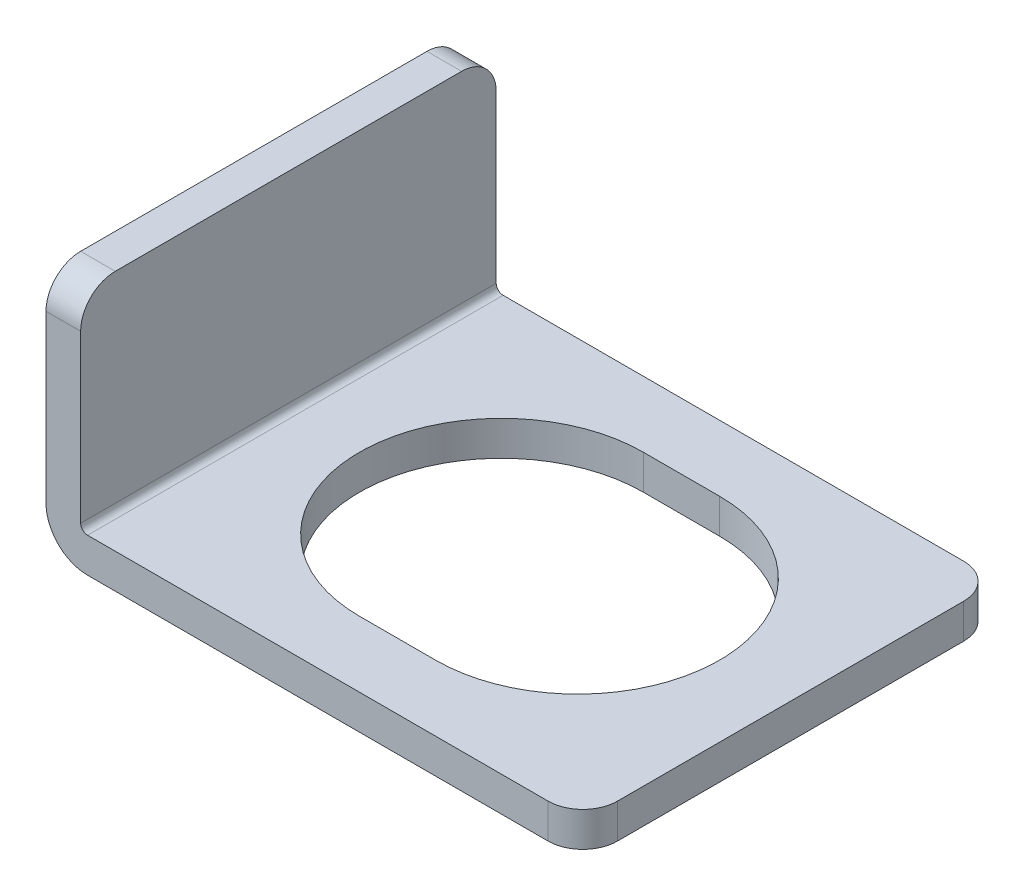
ISO-10303-21;
HEADER;
FILE_DESCRIPTION(('STEP AP214'),'2;1');
FILE_NAME('part.step','',(''),(''),'','','');
FILE_SCHEMA(('AUTOMOTIVE_DESIGN { 1 0 10303 214 1 1 1 1 }'));
ENDSEC;
DATA;
#1=APPLICATION_CONTEXT('core data for automotive mechanical design processes');
#2=APPLICATION_PROTOCOL_DEFINITION('international standard','automotive_design',2000,#1);
#3=PRODUCT_CONTEXT('',#1,'mechanical');
#4=PRODUCT('Part','Part','',(#3));
#5=PRODUCT_RELATED_PRODUCT_CATEGORY('part','',(#4));
#6=PRODUCT_DEFINITION_FORMATION('','',#4);
#7=PRODUCT_DEFINITION_CONTEXT('part definition',#1,'design');
#8=PRODUCT_DEFINITION('design','',#6,#7);
#9=PRODUCT_DEFINITION_SHAPE('','',#8);
#10=(LENGTH_UNIT() NAMED_UNIT(*) SI_UNIT(.MILLI.,.METRE.));
#11=(NAMED_UNIT(*) PLANE_ANGLE_UNIT() SI_UNIT($,.RADIAN.));
#12=(NAMED_UNIT(*) SI_UNIT($,.STERADIAN.) SOLID_ANGLE_UNIT());
#13=UNCERTAINTY_MEASURE_WITH_UNIT(LENGTH_MEASURE(1.E-05),#10,'distance_accuracy_value','');
#14=(GEOMETRIC_REPRESENTATION_CONTEXT(3) GLOBAL_UNCERTAINTY_ASSIGNED_CONTEXT((#13)) GLOBAL_UNIT_ASSIGNED_CONTEXT((#10,
#11,#12)) REPRESENTATION_CONTEXT('',''));
#15=CARTESIAN_POINT('',(0.,0.,0.));
#16=DIRECTION('',(0.,0.,1.));
#17=DIRECTION('',(1.,0.,0.));
#18=AXIS2_PLACEMENT_3D('',#15,#16,#17);
#19=CARTESIAN_POINT('',(0.,7.,6.));
#20=DIRECTION('',(0.,-1.,0.));
#21=DIRECTION('',(0.,0.,-1.));
#22=AXIS2_PLACEMENT_3D('',#19,#20,#21);
#23=PLANE('',#22);
#24=DIRECTION('',(0.,0.,-1.));
#25=VECTOR('',#24,1.);
#26=CARTESIAN_POINT('',(1.,7.,6.));
#27=LINE('',#26,#25);
#28=CARTESIAN_POINT('',(1.,7.,5.));
#29=VERTEX_POINT('',#28);
#30=CARTESIAN_POINT('',(1.,7.,-5.));
#31=VERTEX_POINT('',#30);
#32=EDGE_CURVE('E232',#29,#31,#27,.T.);
#33=ORIENTED_EDGE('',*,*,#32,.T.);
#34=DIRECTION('',(-1.,0.,0.));
#35=VECTOR('',#34,1.);
#36=CARTESIAN_POINT('',(0.,7.,-5.));
#37=LINE('',#36,#35);
#38=CARTESIAN_POINT('',(0.,7.,-5.));
#39=VERTEX_POINT('',#38);
#40=EDGE_CURVE('E284',#31,#39,#37,.T.);
#41=ORIENTED_EDGE('',*,*,#40,.T.);
#42=DIRECTION('',(0.,0.,-1.));
#43=VECTOR('',#42,1.);
#44=CARTESIAN_POINT('',(0.,7.,6.));
#45=LINE('',#44,#43);
#46=CARTESIAN_POINT('',(0.,7.,5.));
#47=VERTEX_POINT('',#46);
#48=EDGE_CURVE('E277',#47,#39,#45,.T.);
#49=ORIENTED_EDGE('',*,*,#48,.F.);
#50=DIRECTION('',(-1.,0.,0.));
#51=VECTOR('',#50,1.);
#52=CARTESIAN_POINT('',(0.,7.,5.));
#53=LINE('',#52,#51);
#54=EDGE_CURVE('E281',#47,#29,#53,.F.);
#55=ORIENTED_EDGE('',*,*,#54,.T.);
#56=EDGE_LOOP('',(#33,#41,#49,#55));
#57=FACE_BOUND('',#56,.T.);
#58=ADVANCED_FACE('F39',(#57),#23,.F.);
#59=CARTESIAN_POINT('',(0.,1.2,6.));
#60=DIRECTION('',(1.,0.,0.));
#61=DIRECTION('',(0.,0.,-1.));
#62=AXIS2_PLACEMENT_3D('',#59,#60,#61);
#63=PLANE('',#62);
#64=ORIENTED_EDGE('',*,*,#48,.T.);
#65=CARTESIAN_POINT('',(0.,6.,-5.));
#66=DIRECTION('',(1.,0.,0.));
#67=DIRECTION('',(0.,0.,-1.));
#68=AXIS2_PLACEMENT_3D('',#65,#66,#67);
#69=CIRCLE('',#68,1.);
#70=CARTESIAN_POINT('',(0.,6.,-6.));
#71=VERTEX_POINT('',#70);
#72=EDGE_CURVE('E291',#39,#71,#69,.F.);
#73=ORIENTED_EDGE('',*,*,#72,.T.);
#74=DIRECTION('',(0.,-1.,0.));
#75=VECTOR('',#74,1.);
#76=CARTESIAN_POINT('',(0.,1.2,-6.));
#77=LINE('',#76,#75);
#78=CARTESIAN_POINT('',(0.,1.2,-6.));
#79=VERTEX_POINT('',#78);
#80=EDGE_CURVE('E206',#71,#79,#77,.T.);
#81=ORIENTED_EDGE('',*,*,#80,.T.);
#82=DIRECTION('',(0.,0.,-1.));
#83=VECTOR('',#82,1.);
#84=CARTESIAN_POINT('',(0.,1.2,6.));
#85=LINE('',#84,#83);
#86=CARTESIAN_POINT('',(0.,1.2,6.));
#87=VERTEX_POINT('',#86);
#88=EDGE_CURVE('E273',#87,#79,#85,.T.);
#89=ORIENTED_EDGE('',*,*,#88,.F.);
#90=DIRECTION('',(0.,-1.,0.));
#91=VECTOR('',#90,1.);
#92=CARTESIAN_POINT('',(0.,1.2,6.));
#93=LINE('',#92,#91);
#94=CARTESIAN_POINT('',(0.,6.,6.));
#95=VERTEX_POINT('',#94);
#96=EDGE_CURVE('E212',#95,#87,#93,.T.);
#97=ORIENTED_EDGE('',*,*,#96,.F.);
#98=CARTESIAN_POINT('',(0.,6.,5.));
#99=DIRECTION('',(1.,0.,0.));
#100=DIRECTION('',(0.,0.,-1.));
#101=AXIS2_PLACEMENT_3D('',#98,#99,#100);
#102=CIRCLE('',#101,1.);
#103=EDGE_CURVE('E288',#95,#47,#102,.F.);
#104=ORIENTED_EDGE('',*,*,#103,.T.);
#105=EDGE_LOOP('',(#64,#73,#81,#89,#97,#104));
#106=FACE_BOUND('',#105,.T.);
#107=ADVANCED_FACE('F332',(#106),#63,.F.);
#108=CARTESIAN_POINT('',(1.2,1.2,6.));
#109=DIRECTION('',(0.,0.,-1.));
#110=DIRECTION('',(-1.,0.,0.));
#111=AXIS2_PLACEMENT_3D('',#108,#109,#110);
#112=CYLINDRICAL_SURFACE('',#111,1.2);
#113=CARTESIAN_POINT('',(1.2,1.2,-6.));
#114=DIRECTION('',(0.,0.,1.));
#115=DIRECTION('',(-1.,0.,0.));
#116=AXIS2_PLACEMENT_3D('',#113,#114,#115);
#117=CIRCLE('',#116,1.2);
#118=CARTESIAN_POINT('',(1.2,0.,-6.));
#119=VERTEX_POINT('',#118);
#120=EDGE_CURVE('E234',#79,#119,#117,.T.);
#121=ORIENTED_EDGE('',*,*,#120,.T.);
#122=DIRECTION('',(0.,0.,-1.));
#123=VECTOR('',#122,1.);
#124=CARTESIAN_POINT('',(1.2,0.,6.));
#125=LINE('',#124,#123);
#126=CARTESIAN_POINT('',(1.2,0.,6.));
#127=VERTEX_POINT('',#126);
#128=EDGE_CURVE('E269',#127,#119,#125,.T.);
#129=ORIENTED_EDGE('',*,*,#128,.F.);
#130=CARTESIAN_POINT('',(1.2,1.2,6.));
#131=DIRECTION('',(0.,0.,1.));
#132=DIRECTION('',(-1.,0.,0.));
#133=AXIS2_PLACEMENT_3D('',#130,#131,#132);
#134=CIRCLE('',#133,1.2);
#135=EDGE_CURVE('E215',#87,#127,#134,.T.);
#136=ORIENTED_EDGE('',*,*,#135,.F.);
#137=ORIENTED_EDGE('',*,*,#88,.T.);
#138=EDGE_LOOP('',(#121,#129,#136,#137));
#139=FACE_BOUND('',#138,.T.);
#140=ADVANCED_FACE('F339',(#139),#112,.T.);
#141=CARTESIAN_POINT('',(1.2,0.,6.));
#142=DIRECTION('',(0.,1.,0.));
#143=DIRECTION('',(0.,0.,1.));
#144=AXIS2_PLACEMENT_3D('',#141,#142,#143);
#145=PLANE('',#144);
#146=DIRECTION('',(-1.,0.,0.));
#147=VECTOR('',#146,1.);
#148=CARTESIAN_POINT('',(7.15,0.,-4.1));
#149=LINE('',#148,#147);
#150=CARTESIAN_POINT('',(9.35,0.,-4.1));
#151=VERTEX_POINT('',#150);
#152=CARTESIAN_POINT('',(7.15,0.,-4.1));
#153=VERTEX_POINT('',#152);
#154=EDGE_CURVE('E168',#151,#153,#149,.T.);
#155=ORIENTED_EDGE('',*,*,#154,.T.);
#156=CARTESIAN_POINT('',(7.15,0.,0.));
#157=DIRECTION('',(0.,1.,0.));
#158=DIRECTION('',(0.,0.,1.));
#159=AXIS2_PLACEMENT_3D('',#156,#157,#158);
#160=CIRCLE('',#159,4.1);
#161=CARTESIAN_POINT('',(7.15,0.,4.1));
#162=VERTEX_POINT('',#161);
#163=EDGE_CURVE('E159',#153,#162,#160,.T.);
#164=ORIENTED_EDGE('',*,*,#163,.T.);
#165=DIRECTION('',(1.,0.,0.));
#166=VECTOR('',#165,1.);
#167=CARTESIAN_POINT('',(7.15,0.,4.1));
#168=LINE('',#167,#166);
#169=CARTESIAN_POINT('',(9.35,0.,4.1));
#170=VERTEX_POINT('',#169);
#171=EDGE_CURVE('E172',#162,#170,#168,.T.);
#172=ORIENTED_EDGE('',*,*,#171,.T.);
#173=CARTESIAN_POINT('',(9.35,0.,0.));
#174=DIRECTION('',(0.,1.,0.));
#175=DIRECTION('',(0.,0.,1.));
#176=AXIS2_PLACEMENT_3D('',#173,#174,#175);
#177=CIRCLE('',#176,4.1);
#178=EDGE_CURVE('E177',#170,#151,#177,.T.);
#179=ORIENTED_EDGE('',*,*,#178,.T.);
#180=EDGE_LOOP('',(#155,#164,#172,#179));
#181=FACE_BOUND('',#180,.T.);
#182=DIRECTION('',(1.,0.,0.));
#183=VECTOR('',#182,1.);
#184=CARTESIAN_POINT('',(1.2,0.,-6.));
#185=LINE('',#184,#183);
#186=CARTESIAN_POINT('',(14.5,0.,-6.));
#187=VERTEX_POINT('',#186);
#188=EDGE_CURVE('E237',#119,#187,#185,.T.);
#189=ORIENTED_EDGE('',*,*,#188,.T.);
#190=CARTESIAN_POINT('',(14.5,0.,-5.));
#191=DIRECTION('',(0.,1.,0.));
#192=DIRECTION('',(0.,0.,1.));
#193=AXIS2_PLACEMENT_3D('',#190,#191,#192);
#194=CIRCLE('',#193,1.);
#195=CARTESIAN_POINT('',(15.5,0.,-5.));
#196=VERTEX_POINT('',#195);
#197=EDGE_CURVE('E319',#187,#196,#194,.F.);
#198=ORIENTED_EDGE('',*,*,#197,.T.);
#199=DIRECTION('',(0.,0.,-1.));
#200=VECTOR('',#199,1.);
#201=CARTESIAN_POINT('',(15.5,0.,6.));
#202=LINE('',#201,#200);
#203=CARTESIAN_POINT('',(15.5,0.,5.));
#204=VERTEX_POINT('',#203);
#205=EDGE_CURVE('E265',#204,#196,#202,.T.);
#206=ORIENTED_EDGE('',*,*,#205,.F.);
#207=CARTESIAN_POINT('',(14.5,0.,5.));
#208=DIRECTION('',(0.,1.,0.));
#209=DIRECTION('',(0.,0.,1.));
#210=AXIS2_PLACEMENT_3D('',#207,#208,#209);
#211=CIRCLE('',#210,1.);
#212=CARTESIAN_POINT('',(14.5,0.,6.));
#213=VERTEX_POINT('',#212);
#214=EDGE_CURVE('E55',#204,#213,#211,.F.);
#215=ORIENTED_EDGE('',*,*,#214,.T.);
#216=DIRECTION('',(1.,0.,0.));
#217=VECTOR('',#216,1.);
#218=CARTESIAN_POINT('',(1.2,0.,6.));
#219=LINE('',#218,#217);
#220=EDGE_CURVE('E219',#127,#213,#219,.T.);
#221=ORIENTED_EDGE('',*,*,#220,.F.);
#222=ORIENTED_EDGE('',*,*,#128,.T.);
#223=EDGE_LOOP('',(#189,#198,#206,#215,#221,#222));
#224=FACE_BOUND('',#223,.T.);
#225=ADVANCED_FACE('F179',(#181,#224),#145,.F.);
#226=CARTESIAN_POINT('',(15.5,1.,6.));
#227=DIRECTION('',(-1.,0.,0.));
#228=DIRECTION('',(0.,0.,1.));
#229=AXIS2_PLACEMENT_3D('',#226,#227,#228);
#230=PLANE('',#229);
#231=ORIENTED_EDGE('',*,*,#205,.T.);
#232=DIRECTION('',(0.,1.,0.));
#233=VECTOR('',#232,1.);
#234=CARTESIAN_POINT('',(15.5,1.,-5.));
#235=LINE('',#234,#233);
#236=CARTESIAN_POINT('',(15.5,1.,-5.));
#237=VERTEX_POINT('',#236);
#238=EDGE_CURVE('E309',#196,#237,#235,.T.);
#239=ORIENTED_EDGE('',*,*,#238,.T.);
#240=DIRECTION('',(0.,0.,-1.));
#241=VECTOR('',#240,1.);
#242=CARTESIAN_POINT('',(15.5,1.,6.));
#243=LINE('',#242,#241);
#244=CARTESIAN_POINT('',(15.5,1.,5.));
#245=VERTEX_POINT('',#244);
#246=EDGE_CURVE('E261',#245,#237,#243,.T.);
#247=ORIENTED_EDGE('',*,*,#246,.F.);
#248=DIRECTION('',(0.,1.,0.));
#249=VECTOR('',#248,1.);
#250=CARTESIAN_POINT('',(15.5,1.,5.));
#251=LINE('',#250,#249);
#252=EDGE_CURVE('E306',#245,#204,#251,.F.);
#253=ORIENTED_EDGE('',*,*,#252,.T.);
#254=EDGE_LOOP('',(#231,#239,#247,#253));
#255=FACE_BOUND('',#254,.T.);
#256=ADVANCED_FACE('F344',(#255),#230,.F.);
#257=CARTESIAN_POINT('',(1.2,1.,6.));
#258=DIRECTION('',(0.,-1.,0.));
#259=DIRECTION('',(0.,0.,-1.));
#260=AXIS2_PLACEMENT_3D('',#257,#258,#259);
#261=PLANE('',#260);
#262=DIRECTION('',(1.,0.,0.));
#263=VECTOR('',#262,1.);
#264=CARTESIAN_POINT('',(7.15,1.,4.1));
#265=LINE('',#264,#263);
#266=CARTESIAN_POINT('',(7.15,1.,4.1));
#267=VERTEX_POINT('',#266);
#268=CARTESIAN_POINT('',(9.35,1.,4.1));
#269=VERTEX_POINT('',#268);
#270=EDGE_CURVE('E197',#267,#269,#265,.T.);
#271=ORIENTED_EDGE('',*,*,#270,.F.);
#272=CARTESIAN_POINT('',(7.15,1.,0.));
#273=DIRECTION('',(0.,1.,0.));
#274=DIRECTION('',(0.,0.,1.));
#275=AXIS2_PLACEMENT_3D('',#272,#273,#274);
#276=CIRCLE('',#275,4.1);
#277=CARTESIAN_POINT('',(7.15,1.,-4.1));
#278=VERTEX_POINT('',#277);
#279=EDGE_CURVE('E162',#278,#267,#276,.T.);
#280=ORIENTED_EDGE('',*,*,#279,.F.);
#281=DIRECTION('',(-1.,0.,0.));
#282=VECTOR('',#281,1.);
#283=CARTESIAN_POINT('',(7.15,1.,-4.1));
#284=LINE('',#283,#282);
#285=CARTESIAN_POINT('',(9.35,1.,-4.1));
#286=VERTEX_POINT('',#285);
#287=EDGE_CURVE('E182',#286,#278,#284,.T.);
#288=ORIENTED_EDGE('',*,*,#287,.F.);
#289=CARTESIAN_POINT('',(9.35,1.,0.));
#290=DIRECTION('',(0.,1.,0.));
#291=DIRECTION('',(0.,0.,1.));
#292=AXIS2_PLACEMENT_3D('',#289,#290,#291);
#293=CIRCLE('',#292,4.1);
#294=EDGE_CURVE('E188',#269,#286,#293,.T.);
#295=ORIENTED_EDGE('',*,*,#294,.F.);
#296=EDGE_LOOP('',(#271,#280,#288,#295));
#297=FACE_BOUND('',#296,.T.);
#298=ORIENTED_EDGE('',*,*,#246,.T.);
#299=CARTESIAN_POINT('',(14.5,1.,-5.));
#300=DIRECTION('',(0.,-1.,0.));
#301=DIRECTION('',(0.,0.,-1.));
#302=AXIS2_PLACEMENT_3D('',#299,#300,#301);
#303=CIRCLE('',#302,1.);
#304=CARTESIAN_POINT('',(14.5,1.,-6.));
#305=VERTEX_POINT('',#304);
#306=EDGE_CURVE('E315',#237,#305,#303,.F.);
#307=ORIENTED_EDGE('',*,*,#306,.T.);
#308=DIRECTION('',(-1.,0.,0.));
#309=VECTOR('',#308,1.);
#310=CARTESIAN_POINT('',(1.2,1.,-6.));
#311=LINE('',#310,#309);
#312=CARTESIAN_POINT('',(1.2,1.,-6.));
#313=VERTEX_POINT('',#312);
#314=EDGE_CURVE('E241',#305,#313,#311,.T.);
#315=ORIENTED_EDGE('',*,*,#314,.T.);
#316=DIRECTION('',(0.,0.,-1.));
#317=VECTOR('',#316,1.);
#318=CARTESIAN_POINT('',(1.2,1.,6.));
#319=LINE('',#318,#317);
#320=CARTESIAN_POINT('',(1.2,1.,6.));
#321=VERTEX_POINT('',#320);
#322=EDGE_CURVE('E257',#321,#313,#319,.T.);
#323=ORIENTED_EDGE('',*,*,#322,.F.);
#324=DIRECTION('',(-1.,0.,0.));
#325=VECTOR('',#324,1.);
#326=CARTESIAN_POINT('',(1.2,1.,6.));
#327=LINE('',#326,#325);
#328=CARTESIAN_POINT('',(14.5,1.,6.));
#329=VERTEX_POINT('',#328);
#330=EDGE_CURVE('E222',#329,#321,#327,.T.);
#331=ORIENTED_EDGE('',*,*,#330,.F.);
#332=CARTESIAN_POINT('',(14.5,1.,5.));
#333=DIRECTION('',(0.,-1.,0.));
#334=DIRECTION('',(0.,0.,-1.));
#335=AXIS2_PLACEMENT_3D('',#332,#333,#334);
#336=CIRCLE('',#335,1.);
#337=EDGE_CURVE('E63',#329,#245,#336,.F.);
#338=ORIENTED_EDGE('',*,*,#337,.T.);
#339=EDGE_LOOP('',(#298,#307,#315,#323,#331,#338));
#340=FACE_BOUND('',#339,.T.);
#341=ADVANCED_FACE('F352',(#297,#340),#261,.F.);
#342=CARTESIAN_POINT('',(1.2,1.2,6.));
#343=DIRECTION('',(0.,0.,-1.));
#344=DIRECTION('',(-1.,0.,0.));
#345=AXIS2_PLACEMENT_3D('',#342,#343,#344);
#346=CYLINDRICAL_SURFACE('',#345,0.2);
#347=CARTESIAN_POINT('',(1.2,1.2,-6.));
#348=DIRECTION('',(0.,0.,-1.));
#349=DIRECTION('',(-1.,0.,0.));
#350=AXIS2_PLACEMENT_3D('',#347,#348,#349);
#351=CIRCLE('',#350,0.2);
#352=CARTESIAN_POINT('',(1.,1.2,-6.));
#353=VERTEX_POINT('',#352);
#354=EDGE_CURVE('E244',#313,#353,#351,.T.);
#355=ORIENTED_EDGE('',*,*,#354,.T.);
#356=DIRECTION('',(0.,0.,-1.));
#357=VECTOR('',#356,1.);
#358=CARTESIAN_POINT('',(1.,1.2,6.));
#359=LINE('',#358,#357);
#360=CARTESIAN_POINT('',(1.,1.2,6.));
#361=VERTEX_POINT('',#360);
#362=EDGE_CURVE('E253',#361,#353,#359,.T.);
#363=ORIENTED_EDGE('',*,*,#362,.F.);
#364=CARTESIAN_POINT('',(1.2,1.2,6.));
#365=DIRECTION('',(0.,0.,-1.));
#366=DIRECTION('',(-1.,0.,0.));
#367=AXIS2_PLACEMENT_3D('',#364,#365,#366);
#368=CIRCLE('',#367,0.2);
#369=EDGE_CURVE('E225',#321,#361,#368,.T.);
#370=ORIENTED_EDGE('',*,*,#369,.F.);
#371=ORIENTED_EDGE('',*,*,#322,.T.);
#372=EDGE_LOOP('',(#355,#363,#370,#371));
#373=FACE_BOUND('',#372,.T.);
#374=ADVANCED_FACE('F358',(#373),#346,.F.);
#375=CARTESIAN_POINT('',(1.,1.2,6.));
#376=DIRECTION('',(-1.,0.,0.));
#377=DIRECTION('',(0.,0.,1.));
#378=AXIS2_PLACEMENT_3D('',#375,#376,#377);
#379=PLANE('',#378);
#380=DIRECTION('',(0.,1.,0.));
#381=VECTOR('',#380,1.);
#382=CARTESIAN_POINT('',(1.,1.2,-6.));
#383=LINE('',#382,#381);
#384=CARTESIAN_POINT('',(1.,6.,-6.));
#385=VERTEX_POINT('',#384);
#386=EDGE_CURVE('E216',#353,#385,#383,.T.);
#387=ORIENTED_EDGE('',*,*,#386,.T.);
#388=CARTESIAN_POINT('',(1.,6.,-5.));
#389=DIRECTION('',(-1.,0.,0.));
#390=DIRECTION('',(0.,0.,1.));
#391=AXIS2_PLACEMENT_3D('',#388,#389,#390);
#392=CIRCLE('',#391,1.);
#393=EDGE_CURVE('E303',#385,#31,#392,.F.);
#394=ORIENTED_EDGE('',*,*,#393,.T.);
#395=ORIENTED_EDGE('',*,*,#32,.F.);
#396=CARTESIAN_POINT('',(1.,6.,5.));
#397=DIRECTION('',(-1.,0.,0.));
#398=DIRECTION('',(0.,0.,1.));
#399=AXIS2_PLACEMENT_3D('',#396,#397,#398);
#400=CIRCLE('',#399,1.);
#401=CARTESIAN_POINT('',(1.,6.,6.));
#402=VERTEX_POINT('',#401);
#403=EDGE_CURVE('E300',#29,#402,#400,.F.);
#404=ORIENTED_EDGE('',*,*,#403,.T.);
#405=DIRECTION('',(0.,1.,0.));
#406=VECTOR('',#405,1.);
#407=CARTESIAN_POINT('',(1.,1.2,6.));
#408=LINE('',#407,#406);
#409=EDGE_CURVE('E228',#361,#402,#408,.T.);
#410=ORIENTED_EDGE('',*,*,#409,.F.);
#411=ORIENTED_EDGE('',*,*,#362,.T.);
#412=EDGE_LOOP('',(#387,#394,#395,#404,#410,#411));
#413=FACE_BOUND('',#412,.T.);
#414=ADVANCED_FACE('F362',(#413),#379,.F.);
#415=CARTESIAN_POINT('',(1.2,1.2,6.));
#416=DIRECTION('',(0.,0.,-1.));
#417=DIRECTION('',(-1.,0.,0.));
#418=AXIS2_PLACEMENT_3D('',#415,#416,#417);
#419=PLANE('',#418);
#420=ORIENTED_EDGE('',*,*,#220,.T.);
#421=DIRECTION('',(0.,1.,0.));
#422=VECTOR('',#421,1.);
#423=CARTESIAN_POINT('',(14.5,1.2,6.));
#424=LINE('',#423,#422);
#425=EDGE_CURVE('E11',#213,#329,#424,.T.);
#426=ORIENTED_EDGE('',*,*,#425,.T.);
#427=ORIENTED_EDGE('',*,*,#330,.T.);
#428=ORIENTED_EDGE('',*,*,#369,.T.);
#429=ORIENTED_EDGE('',*,*,#409,.T.);
#430=DIRECTION('',(-1.,0.,0.));
#431=VECTOR('',#430,1.);
#432=CARTESIAN_POINT('',(1.2,6.,6.));
#433=LINE('',#432,#431);
#434=EDGE_CURVE('E48',#402,#95,#433,.T.);
#435=ORIENTED_EDGE('',*,*,#434,.T.);
#436=ORIENTED_EDGE('',*,*,#96,.T.);
#437=ORIENTED_EDGE('',*,*,#135,.T.);
#438=EDGE_LOOP('',(#420,#426,#427,#428,#429,#435,#436,#437));
#439=FACE_BOUND('',#438,.T.);
#440=ADVANCED_FACE('F326',(#439),#419,.F.);
#441=CARTESIAN_POINT('',(1.2,1.2,-6.));
#442=DIRECTION('',(0.,0.,-1.));
#443=DIRECTION('',(-1.,0.,0.));
#444=AXIS2_PLACEMENT_3D('',#441,#442,#443);
#445=PLANE('',#444);
#446=ORIENTED_EDGE('',*,*,#80,.F.);
#447=DIRECTION('',(-1.,0.,0.));
#448=VECTOR('',#447,1.);
#449=CARTESIAN_POINT('',(1.,6.,-6.));
#450=LINE('',#449,#448);
#451=EDGE_CURVE('E297',#71,#385,#450,.F.);
#452=ORIENTED_EDGE('',*,*,#451,.T.);
#453=ORIENTED_EDGE('',*,*,#386,.F.);
#454=ORIENTED_EDGE('',*,*,#354,.F.);
#455=ORIENTED_EDGE('',*,*,#314,.F.);
#456=DIRECTION('',(0.,1.,0.));
#457=VECTOR('',#456,1.);
#458=CARTESIAN_POINT('',(14.5,0.,-6.));
#459=LINE('',#458,#457);
#460=EDGE_CURVE('E294',#305,#187,#459,.F.);
#461=ORIENTED_EDGE('',*,*,#460,.T.);
#462=ORIENTED_EDGE('',*,*,#188,.F.);
#463=ORIENTED_EDGE('',*,*,#120,.F.);
#464=EDGE_LOOP('',(#446,#452,#453,#454,#455,#461,#462,#463));
#465=FACE_BOUND('',#464,.T.);
#466=ADVANCED_FACE('F370',(#465),#445,.T.);
#467=CARTESIAN_POINT('',(7.15,0.,0.));
#468=DIRECTION('',(0.,1.,0.));
#469=DIRECTION('',(0.,0.,1.));
#470=AXIS2_PLACEMENT_3D('',#467,#468,#469);
#471=CYLINDRICAL_SURFACE('',#470,4.1);
#472=ORIENTED_EDGE('',*,*,#279,.T.);
#473=DIRECTION('',(0.,1.,0.));
#474=VECTOR('',#473,1.);
#475=CARTESIAN_POINT('',(7.15,0.,4.1));
#476=LINE('',#475,#474);
#477=EDGE_CURVE('E155',#162,#267,#476,.T.);
#478=ORIENTED_EDGE('',*,*,#477,.F.);
#479=ORIENTED_EDGE('',*,*,#163,.F.);
#480=DIRECTION('',(0.,1.,0.));
#481=VECTOR('',#480,1.);
#482=CARTESIAN_POINT('',(7.15,0.,-4.1));
#483=LINE('',#482,#481);
#484=EDGE_CURVE('E203',#153,#278,#483,.T.);
#485=ORIENTED_EDGE('',*,*,#484,.T.);
#486=EDGE_LOOP('',(#472,#478,#479,#485));
#487=FACE_BOUND('',#486,.T.);
#488=ADVANCED_FACE('F157',(#487),#471,.F.);
#489=CARTESIAN_POINT('',(7.15,0.,-4.1));
#490=DIRECTION('',(0.,0.,-1.));
#491=DIRECTION('',(-1.,0.,0.));
#492=AXIS2_PLACEMENT_3D('',#489,#490,#491);
#493=PLANE('',#492);
#494=ORIENTED_EDGE('',*,*,#287,.T.);
#495=ORIENTED_EDGE('',*,*,#484,.F.);
#496=ORIENTED_EDGE('',*,*,#154,.F.);
#497=DIRECTION('',(0.,1.,0.));
#498=VECTOR('',#497,1.);
#499=CARTESIAN_POINT('',(9.35,0.,-4.1));
#500=LINE('',#499,#498);
#501=EDGE_CURVE('E207',#151,#286,#500,.T.);
#502=ORIENTED_EDGE('',*,*,#501,.T.);
#503=EDGE_LOOP('',(#494,#495,#496,#502));
#504=FACE_BOUND('',#503,.T.);
#505=ADVANCED_FACE('F407',(#504),#493,.F.);
#506=CARTESIAN_POINT('',(9.35,0.,0.));
#507=DIRECTION('',(0.,1.,0.));
#508=DIRECTION('',(0.,0.,1.));
#509=AXIS2_PLACEMENT_3D('',#506,#507,#508);
#510=CYLINDRICAL_SURFACE('',#509,4.1);
#511=ORIENTED_EDGE('',*,*,#294,.T.);
#512=ORIENTED_EDGE('',*,*,#501,.F.);
#513=ORIENTED_EDGE('',*,*,#178,.F.);
#514=DIRECTION('',(0.,1.,0.));
#515=VECTOR('',#514,1.);
#516=CARTESIAN_POINT('',(9.35,0.,4.1));
#517=LINE('',#516,#515);
#518=EDGE_CURVE('E167',#170,#269,#517,.T.);
#519=ORIENTED_EDGE('',*,*,#518,.T.);
#520=EDGE_LOOP('',(#511,#512,#513,#519));
#521=FACE_BOUND('',#520,.T.);
#522=ADVANCED_FACE('F380',(#521),#510,.F.);
#523=CARTESIAN_POINT('',(7.15,0.,4.1));
#524=DIRECTION('',(0.,0.,1.));
#525=DIRECTION('',(1.,0.,0.));
#526=AXIS2_PLACEMENT_3D('',#523,#524,#525);
#527=PLANE('',#526);
#528=ORIENTED_EDGE('',*,*,#270,.T.);
#529=ORIENTED_EDGE('',*,*,#518,.F.);
#530=ORIENTED_EDGE('',*,*,#171,.F.);
#531=ORIENTED_EDGE('',*,*,#477,.T.);
#532=EDGE_LOOP('',(#528,#529,#530,#531));
#533=FACE_BOUND('',#532,.T.);
#534=ADVANCED_FACE('F173',(#533),#527,.F.);
#535=CARTESIAN_POINT('',(0.,6.,-5.));
#536=DIRECTION('',(1.,0.,0.));
#537=DIRECTION('',(0.,0.,-1.));
#538=AXIS2_PLACEMENT_3D('',#535,#536,#537);
#539=CYLINDRICAL_SURFACE('',#538,1.);
#540=ORIENTED_EDGE('',*,*,#393,.F.);
#541=ORIENTED_EDGE('',*,*,#451,.F.);
#542=ORIENTED_EDGE('',*,*,#72,.F.);
#543=ORIENTED_EDGE('',*,*,#40,.F.);
#544=EDGE_LOOP('',(#540,#541,#542,#543));
#545=FACE_BOUND('',#544,.T.);
#546=ADVANCED_FACE('F372',(#545),#539,.T.);
#547=CARTESIAN_POINT('',(14.5,1.,-5.));
#548=DIRECTION('',(0.,-1.,0.));
#549=DIRECTION('',(0.,0.,-1.));
#550=AXIS2_PLACEMENT_3D('',#547,#548,#549);
#551=CYLINDRICAL_SURFACE('',#550,1.);
#552=ORIENTED_EDGE('',*,*,#197,.F.);
#553=ORIENTED_EDGE('',*,*,#460,.F.);
#554=ORIENTED_EDGE('',*,*,#306,.F.);
#555=ORIENTED_EDGE('',*,*,#238,.F.);
#556=EDGE_LOOP('',(#552,#553,#554,#555));
#557=FACE_BOUND('',#556,.T.);
#558=ADVANCED_FACE('F350',(#557),#551,.T.);
#559=CARTESIAN_POINT('',(14.5,1.2,5.));
#560=DIRECTION('',(0.,1.,0.));
#561=DIRECTION('',(0.,0.,1.));
#562=AXIS2_PLACEMENT_3D('',#559,#560,#561);
#563=CYLINDRICAL_SURFACE('',#562,1.);
#564=ORIENTED_EDGE('',*,*,#214,.F.);
#565=ORIENTED_EDGE('',*,*,#252,.F.);
#566=ORIENTED_EDGE('',*,*,#337,.F.);
#567=ORIENTED_EDGE('',*,*,#425,.F.);
#568=EDGE_LOOP('',(#564,#565,#566,#567));
#569=FACE_BOUND('',#568,.T.);
#570=ADVANCED_FACE('F341',(#569),#563,.T.);
#571=CARTESIAN_POINT('',(1.2,6.,5.));
#572=DIRECTION('',(-1.,0.,0.));
#573=DIRECTION('',(0.,0.,1.));
#574=AXIS2_PLACEMENT_3D('',#571,#572,#573);
#575=CYLINDRICAL_SURFACE('',#574,1.);
#576=ORIENTED_EDGE('',*,*,#403,.F.);
#577=ORIENTED_EDGE('',*,*,#54,.F.);
#578=ORIENTED_EDGE('',*,*,#103,.F.);
#579=ORIENTED_EDGE('',*,*,#434,.F.);
#580=EDGE_LOOP('',(#576,#577,#578,#579));
#581=FACE_BOUND('',#580,.T.);
#582=ADVANCED_FACE('F41',(#581),#575,.T.);
#583=CLOSED_SHELL('',(#58,#107,#140,#225,#256,#341,#374,#414,#440,#466,#488,#505,#522,#534,#546,
#558,#570,#582));
#584=MANIFOLD_SOLID_BREP('B2',#583);
#585=ADVANCED_BREP_SHAPE_REPRESENTATION('',(#18,#584),#14);
#586=SHAPE_DEFINITION_REPRESENTATION(#9,#585);
ENDSEC;
END-ISO-10303-21;
